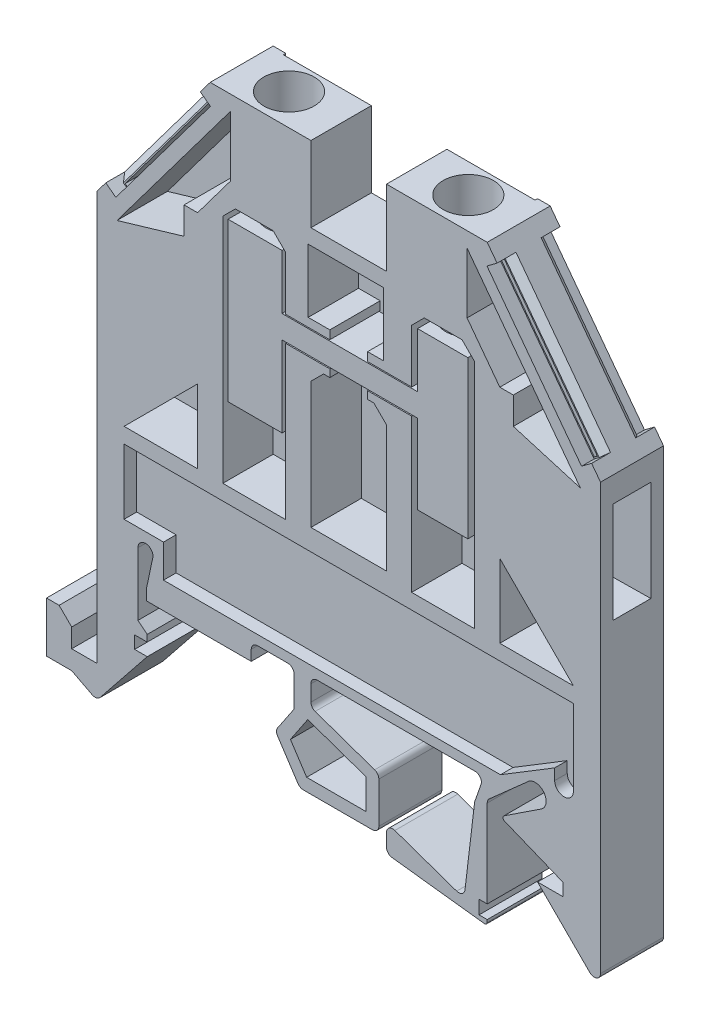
from build123d import *

# Parameters (mm, degrees)
EXTRUDE1_DEPTH  = 5
EXTRUDE2_DEPTH  = 4
EXTRUDE3_DEPTH  = 1
EXTRUDE4_DEPTH  = 4
SKETCH11_R      = 2
EXTRUDE5_DEPTH  = 8.5
SKETCH12_R      = 1.8
EXTRUDE6_DEPTH  = 2
EXTRUDE7_START  = -1
EXTRUDE7_DEPTH  = 1
SKETCH14_W      = 1
SKETCH14_H      = 12.517008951
EXTRUDE8_DEPTH  = 1
CHAMFER1_SIZE   = 0.5
EXTRUDE9_DEPTH  = 1
EXTRUDE10_DEPTH = 1
EXTRUDE11_DEPTH = 62.919302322
CHAMFER2_SIZE   = 0.5
EXTRUDE12_START = -1
EXTRUDE12_DEPTH = 1
EXTRUDE13_DEPTH = 0.2


with BuildPart() as part:
    # Sketch2 → Extrude1 (new body)
    with BuildSketch(Plane.XY):
        with BuildLine():
            Line((0, 2.541736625), (0, 35))
            Line((0, 35), (9, 47))
            Line((9, 47), (17, 47))
            Line((17, 47), (17, 41))
            Line((17, 41), (23, 41))
            Line((23, 41), (23, 47))
            Line((23, 47), (31, 47))
            Line((31, 47), (40, 35))
            Line((40, 35), (40, 1.207106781))
            ThreePointArc((40, 1.207106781), (39.691341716, 0.745167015), (39.146446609, 0.853553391))
            Line((39.146446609, 0.853553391), (35, 5))
            Line((35, 5), (37, 5))
            Line((37, 5), (37, 6))
            Line((37, 6), (32.378644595, 7.874559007))
            ThreePointArc((32.378644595, 7.874559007), (32.254790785, 8.040223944), (32.343823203, 8.226926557))
            Line((32.343823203, 8.226926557), (35.289133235, 10.166520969))
            ThreePointArc((35.289133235, 10.166520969), (35.536140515, 11.366270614), (34.33639087, 11.613277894))
            Line((34.33639087, 11.613277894), (31.168235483, 8.803464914))
            ThreePointArc((31.168235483, 8.803464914), (31.043994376, 8.634472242), (31, 8.429389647))
            Line((31, 8.429389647), (31, 1.491296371))
            Line((31, 1.491296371), (30.354601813, 1.491296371))
            Line((30.354601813, 1.491296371), (30.354601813, 0.416841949))
            Line((30.354601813, 0.416841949), (31, 0.416841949))
            Line((31, 0.416841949), (31, 0.22526897))
            ThreePointArc((31, 0.22526897), (30.932784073, 0.075708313), (30.7763161, 0.026676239))
            Line((30.7763161, 0.026676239), (23.44079025, 0.901501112))
            ThreePointArc((23.44079025, 0.901501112), (23.126098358, 1.066022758), (23, 1.39798294))
            Line((23, 1.39798294), (23, 2.40597793))
            ThreePointArc((23, 2.40597793), (23.210692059, 2.813778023), (23.665203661, 2.877897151))
            Line((23.665203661, 2.877897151), (28.572871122, 1.159881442))
            ThreePointArc((28.572871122, 1.159881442), (29.00268503, 1.207558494), (29.234556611, 1.572590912))
            Line((29.234556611, 1.572590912), (30.003181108, 8.017612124))
            Line((30.003181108, 8.017612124), (30.511112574, 9.468564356))
            ThreePointArc((30.511112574, 9.468564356), (30.446993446, 9.923075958), (30.039193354, 10.133768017))
            Line((30.039193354, 10.133768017), (17.5, 10.133768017))
            ThreePointArc((17.5, 10.133768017), (17.146446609, 9.987321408), (17, 9.633768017))
            Line((17, 9.633768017), (17, 8.37232997))
            ThreePointArc((17, 8.37232997), (17.092199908, 8.083022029), (17.334796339, 7.90041075))
            Line((17.334796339, 7.90041075), (22.058556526, 6.246775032))
            ThreePointArc((22.058556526, 6.246775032), (22.301152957, 6.064163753), (22.393352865, 5.774855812))
            Line((22.393352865, 5.774855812), (22.393352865, 2.532416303))
            ThreePointArc((22.393352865, 2.532416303), (22.246906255, 2.178862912), (21.893352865, 2.032416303))
            Line((21.893352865, 2.032416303), (16.391869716, 2.032416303))
            ThreePointArc((16.391869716, 2.032416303), (16.154696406, 2.09224722), (15.974284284, 2.257421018))
            Line((15.974284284, 2.257421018), (14.351115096, 4.722233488))
            ThreePointArc((14.351115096, 4.722233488), (14.268705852, 4.999536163), (14.35367094, 5.276066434))
            Line((14.35367094, 5.276066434), (15.664024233, 7.226432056))
            Line((15.664024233, 7.226432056), (15.664024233, 9.633768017))
            ThreePointArc((15.664024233, 9.633768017), (15.517577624, 9.987321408), (15.164024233, 10.133768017))
            Line((15.164024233, 10.133768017), (12.758925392, 10.133768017))
            ThreePointArc((12.758925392, 10.133768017), (12.405372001, 9.987321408), (12.258925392, 9.633768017))
            Line((12.258925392, 9.633768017), (12.258925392, 8.803464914))
            Line((12.258925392, 8.803464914), (3.930122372, 8.803464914))
            Line((3.930122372, 8.803464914), (3.930122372, 9.612544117))
            Line((3.930122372, 9.612544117), (4.460002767, 12.123925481))
            ThreePointArc((4.460002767, 12.123925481), (3.860127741, 12.723800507), (3.260252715, 12.123925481))
            Line((3.260252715, 12.123925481), (3.260252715, 7.123925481))
            Line((3.260252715, 7.123925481), (4, 6.532127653))
            Line((4, 6.532127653), (4, 6))
            Line((4, 6), (3, 6))
            Line((3, 6), (3, 5))
            Line((3, 5), (4, 5))
            Line((4, 5), (0.255951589, 0.319939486))
            ThreePointArc((0.255951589, 0.319939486), (-0.030463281, 0.143226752), (-0.364003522, 0.188079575))
            Line((-0.364003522, 0.188079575), (-2, 1.033394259))
            Line((-2, 1.033394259), (-4, 1.033394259))
            Line((-4, 1.033394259), (-4, 5.033394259))
            Line((-4, 5.033394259), (-3, 5.033394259))
            Line((-3, 5.033394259), (-2, 4.041736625))
            Line((-2, 4.041736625), (-2, 2.541736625))
            Line((-2, 2.541736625), (0, 2.541736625))
        make_face()
    extrude(amount=EXTRUDE1_DEPTH)

    # Sketch5 → Extrude2 (cut)
    with BuildSketch(Plane.XY.offset(5)):
        Polygon((15, 38.29674093), (14, 39.29674093), (11, 39.29674093), (10, 38.29674093), (10, 19.921020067), (15, 19.921020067), (15, 32.043880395), (18.5, 32.043880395), (18.5, 31.443880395), (18, 31.443880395), (17, 30.443880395), (17, 20.387678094), (23, 20.387678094), (23, 30.443880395), (22, 31.443880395), (21.5, 31.443880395), (21.5, 32.043880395), (25, 32.043880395), (25, 19.921020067), (30, 19.921020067), (30, 38.29674093), (29, 39.29674093), (26, 39.29674093), (25, 38.29674093), (25, 34.043880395), (21.5, 34.043880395), (21.5, 34.72790088), (22.782598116, 34.72790088), (22.782598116, 39.763398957), (16.782598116, 39.763398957), (16.782598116, 34.72790088), (18.5, 34.72790088), (18.5, 34.043880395), (15, 34.043880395), align=None)
        Polygon((8, 19.921020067), (2.159856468, 19.921020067), (8, 25.761163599), align=None)
        Polygon((32, 25.761163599), (32, 19.921020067), (37.840143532, 19.921020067), align=None)
        Polygon((10.6, 45.8), (10.6, 41), (8, 37.533333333), (6.924824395, 37.533333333), (6.924824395, 35.374396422), (1.6, 33.8), align=None)
        Polygon((33.075175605, 35.374396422), (38.4, 33.8), (29.4, 45.8), (29.4, 41), (32, 37.533333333), (33.075175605, 37.533333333), align=None)
    extrude(amount=-EXTRUDE2_DEPTH, mode=Mode.SUBTRACT)

    # Sketch6 → Extrude3 (cut)
    with BuildSketch(Plane.XY.offset(5)):
        with BuildLine():
            Line((2.159856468, 18.705090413), (37.840143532, 18.705090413))
            Line((37.840143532, 18.705090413), (37.840143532, 12.653636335))
            ThreePointArc((37.840143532, 12.653636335), (37.09811045, 11.911603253), (36.356077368, 12.653636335))
            Line((36.356077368, 12.653636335), (36.356077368, 13.527735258))
            Line((36.356077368, 13.527735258), (32.052821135, 10.905438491))
            Line((32.052821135, 10.905438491), (5.291946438, 10.905438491))
            Line((5.291946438, 10.905438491), (5.291946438, 13.527735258))
            Line((5.291946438, 13.527735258), (2.159856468, 13.527735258))
            Line((2.159856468, 13.527735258), (2.159856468, 18.705090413))
        make_face()
    extrude(amount=-EXTRUDE3_DEPTH, mode=Mode.SUBTRACT)

    # Sketch7 → Cut-Loft1 section 0
    with BuildSketch(Plane.ZY):
        with BuildLine():
            Line((1, 33), (4, 33))
            Line((4, 33), (4, 25))
            Line((4, 25), (1, 25))
            Line((1, 25), (1, 33))
        make_face()
    # Sketch8 → Cut-Loft1 section 1
    with BuildSketch(Plane(origin=(10, 0, 0), x_dir=(0, 0, -1), z_dir=(1, 0, 0))):
        with BuildLine():
            Line((-3.5, 32.267546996), (-2, 32.267546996))
            Line((-2, 32.267546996), (-2, 25.853595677))
            Line((-2, 25.853595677), (-3.5, 25.853595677))
            Line((-3.5, 25.853595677), (-3.5, 32.267546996))
        make_face()
    cut_loft1 = loft(mode=Mode.SUBTRACT)

    # Sketch10 → Extrude4 (add)
    with BuildSketch(Plane.XY.offset(1)):
        Polygon((25.467395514, 32.138009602), (25.467395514, 25.831249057), (29.46115106, 25.831249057), (29.46115106, 38.29674093), (25.467395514, 38.29674093), (25.467395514, 33.955731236), (14.707262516, 33.955731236), (14.707262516, 38.29674093), (10.419781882, 38.29674093), (10.419781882, 25.739990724), (14.707262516, 25.739990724), (14.707262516, 32.138009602), align=None)
    extrude(amount=EXTRUDE4_DEPTH)

    # Sketch11 → Extrude5 (cut)
    with BuildSketch(Plane(origin=(0, 47, 0), x_dir=(1, 0, 0), z_dir=(0, 1, 0))):
        with Locations(Location((12.758925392, -2.5, 0), (0, 0, 270))):
            Circle(SKETCH11_R)
        with Locations(Location((27, -2.5, 0), (0, 0, 270))):
            Circle(SKETCH11_R)
    extrude(amount=-EXTRUDE5_DEPTH, mode=Mode.SUBTRACT)

    # Sketch12 → Extrude6 (add)
    with BuildSketch(Plane(origin=(0, 38.5, 0), x_dir=(1, 0, 0), z_dir=(0, 1, 0))):
        with Locations(Location((12.758925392, -2.5, 0), (0, 0, 123.557309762))):
            Circle(SKETCH12_R)
        with Locations(Location((27, -2.5, 0), (0, 0, 123.557309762))):
            Circle(SKETCH12_R)
    extrude(amount=EXTRUDE6_DEPTH)

    # Sketch13 → Extrude7 (cut)
    with BuildSketch(Plane(origin=(0, 40.5, 0), x_dir=(1, 0, 0), z_dir=(0, 1, 0)).offset(EXTRUDE7_START)):
        with BuildLine():
            Line((12.461795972, -0.724693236), (12.461795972, -4.275306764))
            ThreePointArc((12.461795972, -4.275306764), (12.758925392, -4.314619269), (13.056054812, -4.275306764))
            Line((13.056054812, -4.275306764), (13.056054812, -0.724693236))
            ThreePointArc((13.056054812, -0.724693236), (12.758925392, -0.7), (12.461795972, -0.724693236))
        make_face()
        with BuildLine():
            Line((26.943945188, -0.724693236), (26.943945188, -4.275306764))
            ThreePointArc((26.943945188, -4.275306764), (27.241074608, -4.314619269), (27.538204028, -4.275306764))
            Line((27.538204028, -4.275306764), (27.538204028, -0.724693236))
            ThreePointArc((27.538204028, -0.724693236), (27.241074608, -0.7), (26.943945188, -0.724693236))
        make_face()
    extrude(amount=EXTRUDE7_DEPTH, mode=Mode.SUBTRACT)

    # Sketch14 → Extrude8 (cut)
    with BuildSketch(Plane(origin=(-16.8, 12.6, 0), x_dir=(0, 0, 1), z_dir=(-0.8000000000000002, 0.6, 0))):
        with Locations((0.5, 35.437366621)):
            Rectangle(SKETCH14_W, SKETCH14_H)
        with Locations((4.5, 35.437366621)):
            Rectangle(SKETCH14_W, SKETCH14_H)
    extrude8 = extrude(amount=-EXTRUDE8_DEPTH, mode=Mode.SUBTRACT)

    # Chamfer1
    chamfer1_edges = [part.edges().sort_by_distance(p)[0] for p in [
        (4.462419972, 40.949893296, 1),
        (4.462419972, 40.949893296, 4),
    ]]
    chamfer(chamfer1_edges, length=CHAMFER1_SIZE)

    # Sketch17 → Extrude9 (cut)
    with BuildSketch(Plane.XY.offset(4)):
        Polygon((8.637522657, 45.516696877), (1.247317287, 35.663089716), (1.487317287, 35.483089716), (8.877522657, 45.336696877), align=None)
    extrude9 = extrude(amount=-EXTRUDE9_DEPTH, mode=Mode.SUBTRACT)

    # Sketch18 → Extrude10 (cut)
    with BuildSketch(Plane(origin=(0, 0, 1), x_dir=(-1, 0, 0), z_dir=(0, 0, -1))):
        Polygon((-1.247317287, 35.663089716), (-8.637522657, 45.516696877), (-8.877522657, 45.336696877), (-1.487317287, 35.483089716), align=None)
    extrude10 = extrude(amount=-EXTRUDE10_DEPTH, mode=Mode.SUBTRACT)

    # Sketch19 → Extrude11 (cut, through all)
    with BuildSketch(Plane.XY.offset(5)):
        Polygon((16.49408341, 6.668756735), (16.747800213, 7.046395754), (21.393352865, 5.420137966), (21.393352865, 3.032416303), (16.661281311, 3.032416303), (15.369205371, 4.994457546), align=None)
    extrude(amount=-EXTRUDE11_DEPTH, mode=Mode.SUBTRACT)

    # Mirror4: Cut-Loft1, Extrude8, Extrude9, Extrude10 across plane
    add(cut_loft1.mirror(Plane.ZY.offset(-20)), mode=Mode.SUBTRACT)
    add(extrude8.mirror(Plane.ZY.offset(-20)), mode=Mode.SUBTRACT)
    add(extrude9.mirror(Plane.ZY.offset(-20)), mode=Mode.SUBTRACT)
    add(extrude10.mirror(Plane.ZY.offset(-20)), mode=Mode.SUBTRACT)

    # Chamfer2
    chamfer2_edges = [part.edges().sort_by_distance(p)[0] for p in [
        (35.537580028, 40.949893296, 1),
        (35.537580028, 40.949893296, 4),
    ]]
    chamfer(chamfer2_edges, length=CHAMFER2_SIZE)

    # Sketch20 → Extrude12 (cut)
    with BuildSketch(Plane(origin=(0, 0, 0), x_dir=(-1, 0, 0), z_dir=(0, 0, -1)).offset(EXTRUDE12_START)):
        with BuildLine():
            Line((-37.840143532, 18.705090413), (-2.159856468, 18.705090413))
            Line((-2.159856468, 18.705090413), (-2.159856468, 13.527735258))
            Line((-2.159856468, 13.527735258), (-5.291946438, 13.527735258))
            Line((-5.291946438, 13.527735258), (-5.291946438, 10.905438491))
            Line((-5.291946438, 10.905438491), (-32.052821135, 10.905438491))
            Line((-32.052821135, 10.905438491), (-36.356077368, 13.527735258))
            Line((-36.356077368, 13.527735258), (-36.356077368, 12.653636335))
            ThreePointArc((-36.356077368, 12.653636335), (-37.09811045, 11.911603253), (-37.840143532, 12.653636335))
            Line((-37.840143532, 12.653636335), (-37.840143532, 18.705090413))
        make_face()
    extrude(amount=EXTRUDE12_DEPTH, mode=Mode.SUBTRACT)

    # Sketch21 → Extrude13 (cut)
    with BuildSketch(Plane(origin=(0, 0, 0), x_dir=(-1, 0, 0), z_dir=(0, 0, -1))):
        Polygon((-30, 47), (-30, 37), (-25, 32), (-15, 32), (-10, 37.464598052), (-10, 47), align=None)
    extrude(amount=-EXTRUDE13_DEPTH, mode=Mode.SUBTRACT)


solid = part.part
